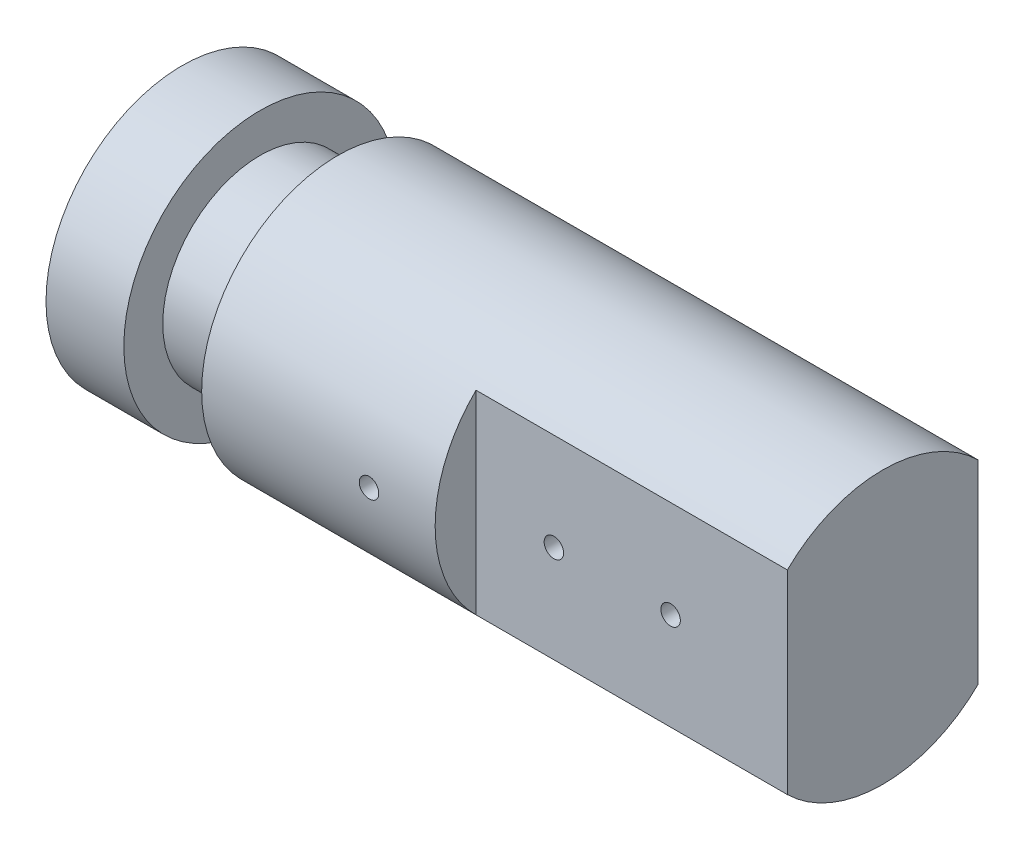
from build123d import *
from build123d.topology import SkipClean

# Parameters (mm, degrees)
M3X0_5_TAPPED_HOLE1_D               = 2.5
M3X0_5_TAPPED_HOLE1_DEPTH           = 3.248924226
M3X0_5_TAPPED_HOLE1_TIP             = 0.751075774
BOSS_EXTRUDE1_START                 = 40
BOSS_EXTRUDE1_DEPTH                 = 40
M3X0_5_TAPPED_HOLE2_D               = 2.5
M3X0_5_TAPPED_HOLE2_DEPTH           = 5
M3X0_5_TAPPED_HOLE2_TIP             = 0.751075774
M3X0_5_TAPPED_HOLE2_ON_FACE_2_D     = 2.5
M3X0_5_TAPPED_HOLE2_ON_FACE_2_DEPTH = 5
M3X0_5_TAPPED_HOLE2_ON_FACE_2_TIP   = 0.751075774


with BuildPart() as part:
    # Sketch1 → Revolve1 (revolve)
    with BuildSketch(Plane.XY, mode=Mode.PRIVATE) as revolve1_sk:
        Polygon((0, 0), (0, 17.5), (10, 17.5), (10, 12.5), (20, 12.5), (20, 17.5), (50, 17.5), (50, 0), align=None)
    revolve(revolve1_sk.sketch.rotate(Axis((0, 0, 0), (1, 0, 0)), 90), axis=Axis((0, 0, 0), (1, 0, 0)))

    # M3x0.5 Tapped Hole1
    with Locations(Plane(origin=(41.5, 0, 17.5), x_dir=(1, 0, 0), z_dir=(0, 0, 1))):
        with Locations((0, 0)):
            Hole(M3X0_5_TAPPED_HOLE1_D / 2, depth=M3X0_5_TAPPED_HOLE1_DEPTH)
            with Locations((0, 0, -(M3X0_5_TAPPED_HOLE1_DEPTH + M3X0_5_TAPPED_HOLE1_TIP / 2))):  # 118° drill point
                Cone(0, M3X0_5_TAPPED_HOLE1_D / 2, M3X0_5_TAPPED_HOLE1_TIP, mode=Mode.SUBTRACT)

    # Sketch3 → Boss-Extrude1 (add)
    with SkipClean():  # the faces are left unmerged after this step: merging them gives an invalid solid
        with BuildSketch(Plane(origin=(50, 0, 0), x_dir=(0, 0, -1), z_dir=(1, 0, 0)).offset(BOSS_EXTRUDE1_START)):
            with BuildLine():
                Line((-12.247448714, -12.5), (-12.247448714, 12.5))
                ThreePointArc((-12.247448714, 12.5), (0, 17.5), (12.247448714, 12.5))
                Line((12.247448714, 12.5), (12.247448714, -12.5))
                ThreePointArc((12.247448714, -12.5), (0, -17.5), (-12.247448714, -12.5))
            make_face()
        extrude(amount=-BOSS_EXTRUDE1_DEPTH)

    # M3x0.5 Tapped Hole2
    with Locations(Plane(origin=(60, 0, 12.247448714), x_dir=(1, 0, 0), z_dir=(0, 0, 1))):
        with Locations((0, 0), (15, 0)):
            Hole(M3X0_5_TAPPED_HOLE2_D / 2, depth=M3X0_5_TAPPED_HOLE2_DEPTH)
            with Locations((0, 0, -(M3X0_5_TAPPED_HOLE2_DEPTH + M3X0_5_TAPPED_HOLE2_TIP / 2))):  # 118° drill point
                Cone(0, M3X0_5_TAPPED_HOLE2_D / 2, M3X0_5_TAPPED_HOLE2_TIP, mode=Mode.SUBTRACT)

    # M3x0.5 Tapped Hole2 on face 2
    with Locations(Plane(origin=(75, 0, -12.247448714), x_dir=(-1, 0, 0), z_dir=(0, 0, -1))):
        with Locations((0, 0), (15, 0)):
            Hole(M3X0_5_TAPPED_HOLE2_ON_FACE_2_D / 2, depth=M3X0_5_TAPPED_HOLE2_ON_FACE_2_DEPTH)
            with Locations((0, 0, -(M3X0_5_TAPPED_HOLE2_ON_FACE_2_DEPTH + M3X0_5_TAPPED_HOLE2_ON_FACE_2_TIP / 2))):  # 118° drill point
                Cone(0, M3X0_5_TAPPED_HOLE2_ON_FACE_2_D / 2, M3X0_5_TAPPED_HOLE2_ON_FACE_2_TIP, mode=Mode.SUBTRACT)


solid = part.part
